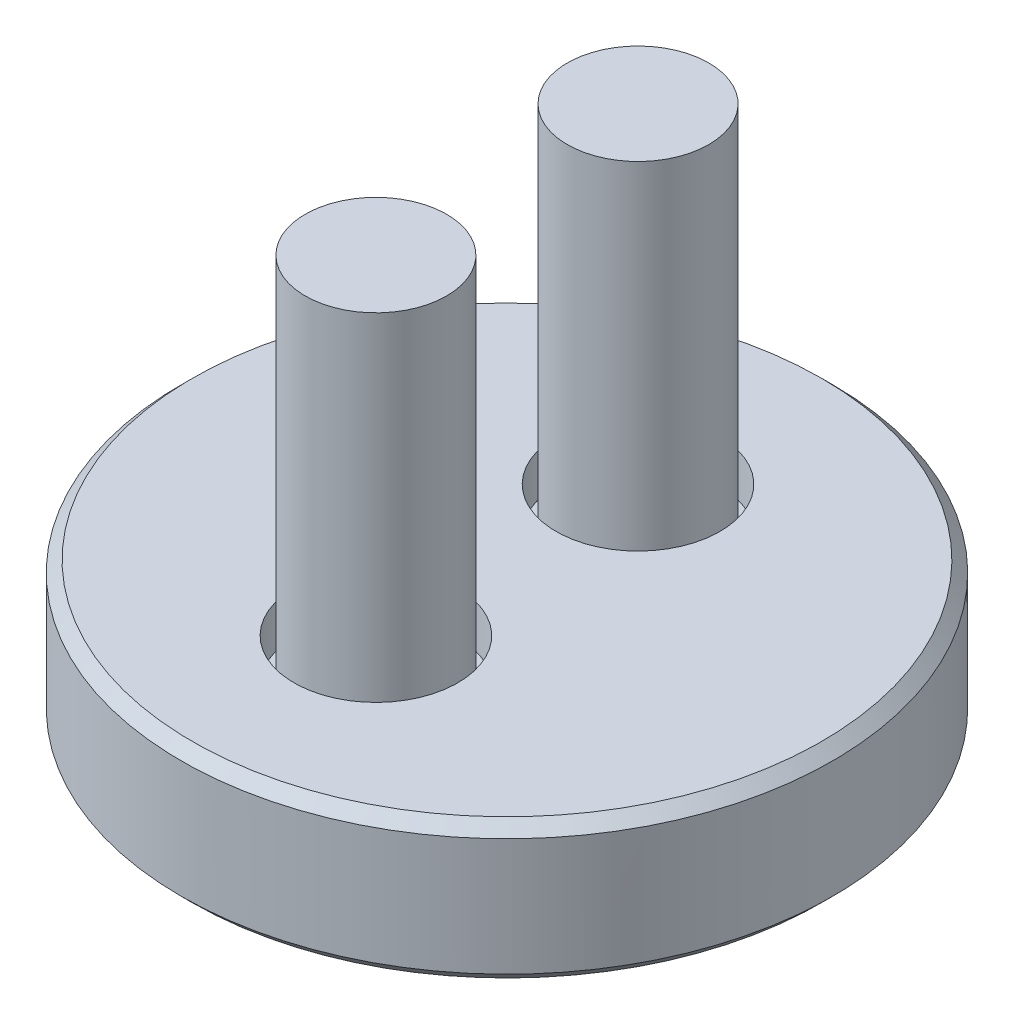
ISO-10303-21;
HEADER;
FILE_DESCRIPTION(('STEP AP214'),'2;1');
FILE_NAME('part.step','',(''),(''),'','','');
FILE_SCHEMA(('AUTOMOTIVE_DESIGN { 1 0 10303 214 1 1 1 1 }'));
ENDSEC;
DATA;
#1=APPLICATION_CONTEXT('core data for automotive mechanical design processes');
#2=APPLICATION_PROTOCOL_DEFINITION('international standard','automotive_design',2000,#1);
#3=PRODUCT_CONTEXT('',#1,'mechanical');
#4=PRODUCT('Part','Part','',(#3));
#5=PRODUCT_RELATED_PRODUCT_CATEGORY('part','',(#4));
#6=PRODUCT_DEFINITION_FORMATION('','',#4);
#7=PRODUCT_DEFINITION_CONTEXT('part definition',#1,'design');
#8=PRODUCT_DEFINITION('design','',#6,#7);
#9=PRODUCT_DEFINITION_SHAPE('','',#8);
#10=(LENGTH_UNIT() NAMED_UNIT(*) SI_UNIT(.MILLI.,.METRE.));
#11=(NAMED_UNIT(*) PLANE_ANGLE_UNIT() SI_UNIT($,.RADIAN.));
#12=(NAMED_UNIT(*) SI_UNIT($,.STERADIAN.) SOLID_ANGLE_UNIT());
#13=UNCERTAINTY_MEASURE_WITH_UNIT(LENGTH_MEASURE(1.E-05),#10,'distance_accuracy_value','');
#14=(GEOMETRIC_REPRESENTATION_CONTEXT(3) GLOBAL_UNCERTAINTY_ASSIGNED_CONTEXT((#13)) GLOBAL_UNIT_ASSIGNED_CONTEXT((#10,
#11,#12)) REPRESENTATION_CONTEXT('',''));
#15=CARTESIAN_POINT('',(0.,0.,0.));
#16=DIRECTION('',(0.,0.,1.));
#17=DIRECTION('',(1.,0.,0.));
#18=AXIS2_PLACEMENT_3D('',#15,#16,#17);
#19=CARTESIAN_POINT('',(0.,16.002,-4.4704));
#20=DIRECTION('',(0.,1.,0.));
#21=DIRECTION('',(1.,0.,0.));
#22=AXIS2_PLACEMENT_3D('',#19,#20,#21);
#23=PLANE('',#22);
#24=CARTESIAN_POINT('',(0.,16.002,-4.4704));
#25=DIRECTION('',(0.,-1.,0.));
#26=DIRECTION('',(1.,0.,0.));
#27=AXIS2_PLACEMENT_3D('',#24,#25,#26);
#28=CIRCLE('',#27,2.413);
#29=CARTESIAN_POINT('',(2.413,16.002,-4.4704));
#30=VERTEX_POINT('',#29);
#31=EDGE_CURVE('E12',#30,#30,#28,.T.);
#32=ORIENTED_EDGE('',*,*,#31,.F.);
#33=EDGE_LOOP('',(#32));
#34=FACE_BOUND('',#33,.T.);
#35=ADVANCED_FACE('F45',(#34),#23,.T.);
#36=CARTESIAN_POINT('',(0.,16.002,-4.4704));
#37=DIRECTION('',(0.,1.,0.));
#38=DIRECTION('',(1.,0.,0.));
#39=AXIS2_PLACEMENT_3D('',#36,#37,#38);
#40=CYLINDRICAL_SURFACE('',#39,2.413);
#41=CARTESIAN_POINT('',(0.,3.302,-4.4704));
#42=DIRECTION('',(0.,-1.,0.));
#43=DIRECTION('',(1.,0.,0.));
#44=AXIS2_PLACEMENT_3D('',#41,#42,#43);
#45=CIRCLE('',#44,2.413);
#46=CARTESIAN_POINT('',(2.413,3.302,-4.4704));
#47=VERTEX_POINT('',#46);
#48=EDGE_CURVE('E52',#47,#47,#45,.T.);
#49=ORIENTED_EDGE('',*,*,#48,.F.);
#50=EDGE_LOOP('',(#49));
#51=FACE_BOUND('',#50,.T.);
#52=ORIENTED_EDGE('',*,*,#31,.T.);
#53=EDGE_LOOP('',(#52));
#54=FACE_BOUND('',#53,.T.);
#55=ADVANCED_FACE('F144',(#51,#54),#40,.T.);
#56=CARTESIAN_POINT('',(0.,3.302,-6.8834));
#57=DIRECTION('',(0.,1.,0.));
#58=DIRECTION('',(1.,0.,0.));
#59=AXIS2_PLACEMENT_3D('',#56,#57,#58);
#60=PLANE('',#59);
#61=CARTESIAN_POINT('',(0.,3.302,-4.4704));
#62=DIRECTION('',(0.,-1.,0.));
#63=DIRECTION('',(1.,0.,0.));
#64=AXIS2_PLACEMENT_3D('',#61,#62,#63);
#65=CIRCLE('',#64,3.9624);
#66=CARTESIAN_POINT('',(3.9624,3.302,-4.4704));
#67=VERTEX_POINT('',#66);
#68=EDGE_CURVE('E137',#67,#67,#65,.T.);
#69=ORIENTED_EDGE('',*,*,#68,.F.);
#70=EDGE_LOOP('',(#69));
#71=FACE_BOUND('',#70,.T.);
#72=ORIENTED_EDGE('',*,*,#48,.T.);
#73=EDGE_LOOP('',(#72));
#74=FACE_BOUND('',#73,.T.);
#75=ADVANCED_FACE('F142',(#71,#74),#60,.T.);
#76=CARTESIAN_POINT('',(0.,16.002,-4.4704));
#77=DIRECTION('',(0.,1.,0.));
#78=DIRECTION('',(1.,0.,0.));
#79=AXIS2_PLACEMENT_3D('',#76,#77,#78);
#80=CYLINDRICAL_SURFACE('',#79,3.9624);
#81=CARTESIAN_POINT('',(0.,0.939800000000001,-4.4704));
#82=DIRECTION('',(0.,-1.,0.));
#83=DIRECTION('',(1.,0.,0.));
#84=AXIS2_PLACEMENT_3D('',#81,#82,#83);
#85=CIRCLE('',#84,3.9624);
#86=CARTESIAN_POINT('',(3.9624,0.939800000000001,-4.4704));
#87=VERTEX_POINT('',#86);
#88=EDGE_CURVE('E134',#87,#87,#85,.T.);
#89=ORIENTED_EDGE('',*,*,#88,.F.);
#90=EDGE_LOOP('',(#89));
#91=FACE_BOUND('',#90,.T.);
#92=ORIENTED_EDGE('',*,*,#68,.T.);
#93=EDGE_LOOP('',(#92));
#94=FACE_BOUND('',#93,.T.);
#95=ADVANCED_FACE('F162',(#91,#94),#80,.T.);
#96=CARTESIAN_POINT('',(0.,0.939800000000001,-8.4328));
#97=DIRECTION('',(0.,-1.,0.));
#98=DIRECTION('',(-1.,0.,0.));
#99=AXIS2_PLACEMENT_3D('',#96,#97,#98);
#100=PLANE('',#99);
#101=DIRECTION('',(0.866025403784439,0.,-0.5));
#102=VECTOR('',#101,1.);
#103=CARTESIAN_POINT('',(0.,0.939800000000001,-3.10658319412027));
#104=LINE('',#103,#102);
#105=CARTESIAN_POINT('',(0.,0.939800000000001,-3.10658319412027));
#106=VERTEX_POINT('',#105);
#107=CARTESIAN_POINT('',(1.1811,0.939800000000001,-3.78849159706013));
#108=VERTEX_POINT('',#107);
#109=EDGE_CURVE('E260',#106,#108,#104,.T.);
#110=ORIENTED_EDGE('',*,*,#109,.T.);
#111=DIRECTION('',(0.,0.,-1.));
#112=VECTOR('',#111,1.);
#113=CARTESIAN_POINT('',(1.1811,0.939800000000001,-3.78849159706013));
#114=LINE('',#113,#112);
#115=CARTESIAN_POINT('',(1.1811,0.939800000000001,-5.15230840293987));
#116=VERTEX_POINT('',#115);
#117=EDGE_CURVE('E254',#108,#116,#114,.T.);
#118=ORIENTED_EDGE('',*,*,#117,.T.);
#119=DIRECTION('',(-0.866025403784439,0.,-0.5));
#120=VECTOR('',#119,1.);
#121=CARTESIAN_POINT('',(1.1811,0.939800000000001,-5.15230840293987));
#122=LINE('',#121,#120);
#123=CARTESIAN_POINT('',(0.,0.939800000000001,-5.83421680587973));
#124=VERTEX_POINT('',#123);
#125=EDGE_CURVE('E259',#116,#124,#122,.T.);
#126=ORIENTED_EDGE('',*,*,#125,.T.);
#127=DIRECTION('',(-0.866025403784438,0.,0.5));
#128=VECTOR('',#127,1.);
#129=CARTESIAN_POINT('',(0.,0.939800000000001,-5.83421680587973));
#130=LINE('',#129,#128);
#131=CARTESIAN_POINT('',(-1.1811,0.939800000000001,-5.15230840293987));
#132=VERTEX_POINT('',#131);
#133=EDGE_CURVE('E268',#124,#132,#130,.T.);
#134=ORIENTED_EDGE('',*,*,#133,.T.);
#135=DIRECTION('',(0.,0.,1.));
#136=VECTOR('',#135,1.);
#137=CARTESIAN_POINT('',(-1.1811,0.939800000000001,-5.15230840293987));
#138=LINE('',#137,#136);
#139=CARTESIAN_POINT('',(-1.1811,0.939800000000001,-3.78849159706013));
#140=VERTEX_POINT('',#139);
#141=EDGE_CURVE('E123',#132,#140,#138,.T.);
#142=ORIENTED_EDGE('',*,*,#141,.T.);
#143=DIRECTION('',(0.866025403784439,0.,0.5));
#144=VECTOR('',#143,1.);
#145=CARTESIAN_POINT('',(-1.1811,0.939800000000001,-3.78849159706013));
#146=LINE('',#145,#144);
#147=EDGE_CURVE('E263',#140,#106,#146,.T.);
#148=ORIENTED_EDGE('',*,*,#147,.T.);
#149=EDGE_LOOP('',(#110,#118,#126,#134,#142,#148));
#150=FACE_BOUND('',#149,.T.);
#151=ORIENTED_EDGE('',*,*,#88,.T.);
#152=EDGE_LOOP('',(#151));
#153=FACE_BOUND('',#152,.T.);
#154=ADVANCED_FACE('F170',(#150,#153),#100,.T.);
#155=CARTESIAN_POINT('',(0.,2.9718,-3.10658319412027));
#156=DIRECTION('',(0.5,0.,0.866025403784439));
#157=DIRECTION('',(-0.866025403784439,0.,0.5));
#158=AXIS2_PLACEMENT_3D('',#155,#156,#157);
#159=PLANE('',#158);
#160=ORIENTED_EDGE('',*,*,#109,.F.);
#161=DIRECTION('',(0.,-1.,0.));
#162=VECTOR('',#161,1.);
#163=CARTESIAN_POINT('',(0.,2.9718,-3.10658319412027));
#164=LINE('',#163,#162);
#165=CARTESIAN_POINT('',(0.,2.9718,-3.10658319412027));
#166=VERTEX_POINT('',#165);
#167=EDGE_CURVE('E90',#166,#106,#164,.T.);
#168=ORIENTED_EDGE('',*,*,#167,.F.);
#169=DIRECTION('',(0.866025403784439,0.,-0.5));
#170=VECTOR('',#169,1.);
#171=CARTESIAN_POINT('',(0.,2.9718,-3.10658319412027));
#172=LINE('',#171,#170);
#173=CARTESIAN_POINT('',(1.1811,2.9718,-3.78849159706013));
#174=VERTEX_POINT('',#173);
#175=EDGE_CURVE('E271',#166,#174,#172,.T.);
#176=ORIENTED_EDGE('',*,*,#175,.T.);
#177=DIRECTION('',(0.,-1.,0.));
#178=VECTOR('',#177,1.);
#179=CARTESIAN_POINT('',(1.1811,2.9718,-3.78849159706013));
#180=LINE('',#179,#178);
#181=EDGE_CURVE('E59',#174,#108,#180,.T.);
#182=ORIENTED_EDGE('',*,*,#181,.T.);
#183=EDGE_LOOP('',(#160,#168,#176,#182));
#184=FACE_BOUND('',#183,.T.);
#185=ADVANCED_FACE('F178',(#184),#159,.F.);
#186=CARTESIAN_POINT('',(-1.1811,2.9718,-3.78849159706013));
#187=DIRECTION('',(-0.5,0.,0.866025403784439));
#188=DIRECTION('',(-0.866025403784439,0.,-0.5));
#189=AXIS2_PLACEMENT_3D('',#186,#187,#188);
#190=PLANE('',#189);
#191=ORIENTED_EDGE('',*,*,#147,.F.);
#192=DIRECTION('',(0.,-1.,0.));
#193=VECTOR('',#192,1.);
#194=CARTESIAN_POINT('',(-1.1811,2.9718,-3.78849159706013));
#195=LINE('',#194,#193);
#196=CARTESIAN_POINT('',(-1.1811,2.9718,-3.78849159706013));
#197=VERTEX_POINT('',#196);
#198=EDGE_CURVE('E125',#197,#140,#195,.T.);
#199=ORIENTED_EDGE('',*,*,#198,.F.);
#200=DIRECTION('',(0.866025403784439,0.,0.5));
#201=VECTOR('',#200,1.);
#202=CARTESIAN_POINT('',(-1.1811,2.9718,-3.78849159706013));
#203=LINE('',#202,#201);
#204=EDGE_CURVE('E68',#197,#166,#203,.T.);
#205=ORIENTED_EDGE('',*,*,#204,.T.);
#206=ORIENTED_EDGE('',*,*,#167,.T.);
#207=EDGE_LOOP('',(#191,#199,#205,#206));
#208=FACE_BOUND('',#207,.T.);
#209=ADVANCED_FACE('F186',(#208),#190,.F.);
#210=CARTESIAN_POINT('',(-1.1811,2.9718,-5.15230840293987));
#211=DIRECTION('',(-1.,0.,0.));
#212=DIRECTION('',(0.,0.,-1.));
#213=AXIS2_PLACEMENT_3D('',#210,#211,#212);
#214=PLANE('',#213);
#215=ORIENTED_EDGE('',*,*,#141,.F.);
#216=DIRECTION('',(0.,-1.,0.));
#217=VECTOR('',#216,1.);
#218=CARTESIAN_POINT('',(-1.1811,2.9718,-5.15230840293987));
#219=LINE('',#218,#217);
#220=CARTESIAN_POINT('',(-1.1811,2.9718,-5.15230840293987));
#221=VERTEX_POINT('',#220);
#222=EDGE_CURVE('E112',#221,#132,#219,.T.);
#223=ORIENTED_EDGE('',*,*,#222,.F.);
#224=DIRECTION('',(0.,0.,1.));
#225=VECTOR('',#224,1.);
#226=CARTESIAN_POINT('',(-1.1811,2.9718,-5.15230840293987));
#227=LINE('',#226,#225);
#228=EDGE_CURVE('E115',#221,#197,#227,.T.);
#229=ORIENTED_EDGE('',*,*,#228,.T.);
#230=ORIENTED_EDGE('',*,*,#198,.T.);
#231=EDGE_LOOP('',(#215,#223,#229,#230));
#232=FACE_BOUND('',#231,.T.);
#233=ADVANCED_FACE('F121',(#232),#214,.F.);
#234=CARTESIAN_POINT('',(0.,2.9718,-5.83421680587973));
#235=DIRECTION('',(-0.5,0.,-0.866025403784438));
#236=DIRECTION('',(0.866025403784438,0.,-0.5));
#237=AXIS2_PLACEMENT_3D('',#234,#235,#236);
#238=PLANE('',#237);
#239=ORIENTED_EDGE('',*,*,#133,.F.);
#240=DIRECTION('',(0.,-1.,0.));
#241=VECTOR('',#240,1.);
#242=CARTESIAN_POINT('',(0.,2.9718,-5.83421680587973));
#243=LINE('',#242,#241);
#244=CARTESIAN_POINT('',(0.,2.9718,-5.83421680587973));
#245=VERTEX_POINT('',#244);
#246=EDGE_CURVE('E114',#245,#124,#243,.T.);
#247=ORIENTED_EDGE('',*,*,#246,.F.);
#248=DIRECTION('',(-0.866025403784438,0.,0.5));
#249=VECTOR('',#248,1.);
#250=CARTESIAN_POINT('',(0.,2.9718,-5.83421680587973));
#251=LINE('',#250,#249);
#252=EDGE_CURVE('E107',#245,#221,#251,.T.);
#253=ORIENTED_EDGE('',*,*,#252,.T.);
#254=ORIENTED_EDGE('',*,*,#222,.T.);
#255=EDGE_LOOP('',(#239,#247,#253,#254));
#256=FACE_BOUND('',#255,.T.);
#257=ADVANCED_FACE('F110',(#256),#238,.F.);
#258=CARTESIAN_POINT('',(1.1811,2.9718,-5.15230840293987));
#259=DIRECTION('',(0.5,0.,-0.866025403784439));
#260=DIRECTION('',(0.866025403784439,0.,0.5));
#261=AXIS2_PLACEMENT_3D('',#258,#259,#260);
#262=PLANE('',#261);
#263=ORIENTED_EDGE('',*,*,#125,.F.);
#264=DIRECTION('',(0.,-1.,0.));
#265=VECTOR('',#264,1.);
#266=CARTESIAN_POINT('',(1.1811,2.9718,-5.15230840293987));
#267=LINE('',#266,#265);
#268=CARTESIAN_POINT('',(1.1811,2.9718,-5.15230840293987));
#269=VERTEX_POINT('',#268);
#270=EDGE_CURVE('E128',#269,#116,#267,.T.);
#271=ORIENTED_EDGE('',*,*,#270,.F.);
#272=DIRECTION('',(-0.866025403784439,0.,-0.5));
#273=VECTOR('',#272,1.);
#274=CARTESIAN_POINT('',(1.1811,2.9718,-5.15230840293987));
#275=LINE('',#274,#273);
#276=EDGE_CURVE('E116',#269,#245,#275,.T.);
#277=ORIENTED_EDGE('',*,*,#276,.T.);
#278=ORIENTED_EDGE('',*,*,#246,.T.);
#279=EDGE_LOOP('',(#263,#271,#277,#278));
#280=FACE_BOUND('',#279,.T.);
#281=ADVANCED_FACE('F205',(#280),#262,.F.);
#282=CARTESIAN_POINT('',(1.1811,2.9718,-3.78849159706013));
#283=DIRECTION('',(1.,0.,0.));
#284=DIRECTION('',(0.,-1.,0.));
#285=AXIS2_PLACEMENT_3D('',#282,#283,#284);
#286=PLANE('',#285);
#287=ORIENTED_EDGE('',*,*,#117,.F.);
#288=ORIENTED_EDGE('',*,*,#181,.F.);
#289=DIRECTION('',(0.,0.,-1.));
#290=VECTOR('',#289,1.);
#291=CARTESIAN_POINT('',(1.1811,2.9718,-3.78849159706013));
#292=LINE('',#291,#290);
#293=EDGE_CURVE('E98',#174,#269,#292,.T.);
#294=ORIENTED_EDGE('',*,*,#293,.T.);
#295=ORIENTED_EDGE('',*,*,#270,.T.);
#296=EDGE_LOOP('',(#287,#288,#294,#295));
#297=FACE_BOUND('',#296,.T.);
#298=ADVANCED_FACE('F212',(#297),#286,.F.);
#299=CARTESIAN_POINT('',(2.3622,2.9718,-4.4704));
#300=DIRECTION('',(0.,-1.,0.));
#301=DIRECTION('',(-1.,0.,0.));
#302=AXIS2_PLACEMENT_3D('',#299,#300,#301);
#303=PLANE('',#302);
#304=ORIENTED_EDGE('',*,*,#175,.F.);
#305=ORIENTED_EDGE('',*,*,#204,.F.);
#306=ORIENTED_EDGE('',*,*,#228,.F.);
#307=ORIENTED_EDGE('',*,*,#252,.F.);
#308=ORIENTED_EDGE('',*,*,#276,.F.);
#309=ORIENTED_EDGE('',*,*,#293,.F.);
#310=EDGE_LOOP('',(#304,#305,#306,#307,#308,#309));
#311=FACE_BOUND('',#310,.T.);
#312=ADVANCED_FACE('F118',(#311),#303,.T.);
#313=CLOSED_SHELL('',(#35,#55,#75,#95,#154,#185,#209,#233,#257,#281,#298,#312));
#314=MANIFOLD_SOLID_BREP('B2',#313);
#315=CARTESIAN_POINT('',(0.,16.002,4.4704));
#316=DIRECTION('',(0.,1.,0.));
#317=DIRECTION('',(1.,0.,0.));
#318=AXIS2_PLACEMENT_3D('',#315,#316,#317);
#319=PLANE('',#318);
#320=CARTESIAN_POINT('',(0.,16.002,4.4704));
#321=DIRECTION('',(0.,1.,0.));
#322=DIRECTION('',(1.,0.,0.));
#323=AXIS2_PLACEMENT_3D('',#320,#321,#322);
#324=CIRCLE('',#323,2.413);
#325=CARTESIAN_POINT('',(2.413,16.002,4.4704));
#326=VERTEX_POINT('',#325);
#327=EDGE_CURVE('E43',#326,#326,#324,.T.);
#328=ORIENTED_EDGE('',*,*,#327,.T.);
#329=EDGE_LOOP('',(#328));
#330=FACE_BOUND('',#329,.T.);
#331=ADVANCED_FACE('F290',(#330),#319,.T.);
#332=CARTESIAN_POINT('',(0.,16.002,4.4704));
#333=DIRECTION('',(0.,1.,0.));
#334=DIRECTION('',(1.,0.,0.));
#335=AXIS2_PLACEMENT_3D('',#332,#333,#334);
#336=CYLINDRICAL_SURFACE('',#335,2.413);
#337=CARTESIAN_POINT('',(0.,3.302,4.4704));
#338=DIRECTION('',(0.,1.,0.));
#339=DIRECTION('',(1.,0.,0.));
#340=AXIS2_PLACEMENT_3D('',#337,#338,#339);
#341=CIRCLE('',#340,2.413);
#342=CARTESIAN_POINT('',(2.413,3.302,4.4704));
#343=VERTEX_POINT('',#342);
#344=EDGE_CURVE('E297',#343,#343,#341,.T.);
#345=ORIENTED_EDGE('',*,*,#344,.T.);
#346=EDGE_LOOP('',(#345));
#347=FACE_BOUND('',#346,.T.);
#348=ORIENTED_EDGE('',*,*,#327,.F.);
#349=EDGE_LOOP('',(#348));
#350=FACE_BOUND('',#349,.T.);
#351=ADVANCED_FACE('F404',(#347,#350),#336,.T.);
#352=CARTESIAN_POINT('',(0.,3.302,6.8834));
#353=DIRECTION('',(0.,1.,0.));
#354=DIRECTION('',(1.,0.,0.));
#355=AXIS2_PLACEMENT_3D('',#352,#353,#354);
#356=PLANE('',#355);
#357=CARTESIAN_POINT('',(0.,3.302,4.4704));
#358=DIRECTION('',(0.,1.,0.));
#359=DIRECTION('',(1.,0.,0.));
#360=AXIS2_PLACEMENT_3D('',#357,#358,#359);
#361=CIRCLE('',#360,3.9624);
#362=CARTESIAN_POINT('',(3.9624,3.302,4.4704));
#363=VERTEX_POINT('',#362);
#364=EDGE_CURVE('E399',#363,#363,#361,.T.);
#365=ORIENTED_EDGE('',*,*,#364,.T.);
#366=EDGE_LOOP('',(#365));
#367=FACE_BOUND('',#366,.T.);
#368=ORIENTED_EDGE('',*,*,#344,.F.);
#369=EDGE_LOOP('',(#368));
#370=FACE_BOUND('',#369,.T.);
#371=ADVANCED_FACE('F407',(#367,#370),#356,.T.);
#372=CARTESIAN_POINT('',(0.,16.002,4.4704));
#373=DIRECTION('',(0.,1.,0.));
#374=DIRECTION('',(1.,0.,0.));
#375=AXIS2_PLACEMENT_3D('',#372,#373,#374);
#376=CYLINDRICAL_SURFACE('',#375,3.9624);
#377=CARTESIAN_POINT('',(0.,0.939800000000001,4.4704));
#378=DIRECTION('',(0.,1.,0.));
#379=DIRECTION('',(1.,0.,0.));
#380=AXIS2_PLACEMENT_3D('',#377,#378,#379);
#381=CIRCLE('',#380,3.9624);
#382=CARTESIAN_POINT('',(3.9624,0.939800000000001,4.4704));
#383=VERTEX_POINT('',#382);
#384=EDGE_CURVE('E391',#383,#383,#381,.T.);
#385=ORIENTED_EDGE('',*,*,#384,.T.);
#386=EDGE_LOOP('',(#385));
#387=FACE_BOUND('',#386,.T.);
#388=ORIENTED_EDGE('',*,*,#364,.F.);
#389=EDGE_LOOP('',(#388));
#390=FACE_BOUND('',#389,.T.);
#391=ADVANCED_FACE('F409',(#387,#390),#376,.T.);
#392=CARTESIAN_POINT('',(0.,0.939800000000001,8.4328));
#393=DIRECTION('',(0.,-1.,0.));
#394=DIRECTION('',(-1.,0.,0.));
#395=AXIS2_PLACEMENT_3D('',#392,#393,#394);
#396=PLANE('',#395);
#397=DIRECTION('',(0.866025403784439,0.,0.5));
#398=VECTOR('',#397,1.);
#399=CARTESIAN_POINT('',(0.,0.939800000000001,3.10658319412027));
#400=LINE('',#399,#398);
#401=CARTESIAN_POINT('',(0.,0.939800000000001,3.10658319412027));
#402=VERTEX_POINT('',#401);
#403=CARTESIAN_POINT('',(1.1811,0.939800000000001,3.78849159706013));
#404=VERTEX_POINT('',#403);
#405=EDGE_CURVE('E304',#402,#404,#400,.T.);
#406=ORIENTED_EDGE('',*,*,#405,.F.);
#407=DIRECTION('',(0.866025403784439,0.,-0.5));
#408=VECTOR('',#407,1.);
#409=CARTESIAN_POINT('',(-1.1811,0.939800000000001,3.78849159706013));
#410=LINE('',#409,#408);
#411=CARTESIAN_POINT('',(-1.1811,0.939800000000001,3.78849159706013));
#412=VERTEX_POINT('',#411);
#413=EDGE_CURVE('E387',#412,#402,#410,.T.);
#414=ORIENTED_EDGE('',*,*,#413,.F.);
#415=DIRECTION('',(0.,0.,-1.));
#416=VECTOR('',#415,1.);
#417=CARTESIAN_POINT('',(-1.1811,0.939800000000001,5.15230840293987));
#418=LINE('',#417,#416);
#419=CARTESIAN_POINT('',(-1.1811,0.939800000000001,5.15230840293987));
#420=VERTEX_POINT('',#419);
#421=EDGE_CURVE('E385',#420,#412,#418,.T.);
#422=ORIENTED_EDGE('',*,*,#421,.F.);
#423=DIRECTION('',(-0.866025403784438,0.,-0.5));
#424=VECTOR('',#423,1.);
#425=CARTESIAN_POINT('',(0.,0.939800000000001,5.83421680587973));
#426=LINE('',#425,#424);
#427=CARTESIAN_POINT('',(0.,0.939800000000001,5.83421680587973));
#428=VERTEX_POINT('',#427);
#429=EDGE_CURVE('E352',#428,#420,#426,.T.);
#430=ORIENTED_EDGE('',*,*,#429,.F.);
#431=DIRECTION('',(-0.866025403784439,0.,0.5));
#432=VECTOR('',#431,1.);
#433=CARTESIAN_POINT('',(1.1811,0.939800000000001,5.15230840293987));
#434=LINE('',#433,#432);
#435=CARTESIAN_POINT('',(1.1811,0.939800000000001,5.15230840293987));
#436=VERTEX_POINT('',#435);
#437=EDGE_CURVE('E381',#436,#428,#434,.T.);
#438=ORIENTED_EDGE('',*,*,#437,.F.);
#439=DIRECTION('',(0.,0.,1.));
#440=VECTOR('',#439,1.);
#441=CARTESIAN_POINT('',(1.1811,0.939800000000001,3.78849159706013));
#442=LINE('',#441,#440);
#443=EDGE_CURVE('E378',#404,#436,#442,.T.);
#444=ORIENTED_EDGE('',*,*,#443,.F.);
#445=EDGE_LOOP('',(#406,#414,#422,#430,#438,#444));
#446=FACE_BOUND('',#445,.T.);
#447=ORIENTED_EDGE('',*,*,#384,.F.);
#448=EDGE_LOOP('',(#447));
#449=FACE_BOUND('',#448,.T.);
#450=ADVANCED_FACE('F416',(#446,#449),#396,.T.);
#451=CARTESIAN_POINT('',(0.,2.9718,3.10658319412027));
#452=DIRECTION('',(0.5,0.,-0.866025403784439));
#453=DIRECTION('',(-0.866025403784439,0.,-0.5));
#454=AXIS2_PLACEMENT_3D('',#451,#452,#453);
#455=PLANE('',#454);
#456=ORIENTED_EDGE('',*,*,#405,.T.);
#457=DIRECTION('',(0.,-1.,0.));
#458=VECTOR('',#457,1.);
#459=CARTESIAN_POINT('',(1.1811,2.9718,3.78849159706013));
#460=LINE('',#459,#458);
#461=CARTESIAN_POINT('',(1.1811,2.9718,3.78849159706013));
#462=VERTEX_POINT('',#461);
#463=EDGE_CURVE('E334',#462,#404,#460,.T.);
#464=ORIENTED_EDGE('',*,*,#463,.F.);
#465=DIRECTION('',(0.866025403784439,0.,0.5));
#466=VECTOR('',#465,1.);
#467=CARTESIAN_POINT('',(0.,2.9718,3.10658319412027));
#468=LINE('',#467,#466);
#469=CARTESIAN_POINT('',(0.,2.9718,3.10658319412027));
#470=VERTEX_POINT('',#469);
#471=EDGE_CURVE('E389',#470,#462,#468,.T.);
#472=ORIENTED_EDGE('',*,*,#471,.F.);
#473=DIRECTION('',(0.,-1.,0.));
#474=VECTOR('',#473,1.);
#475=CARTESIAN_POINT('',(0.,2.9718,3.10658319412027));
#476=LINE('',#475,#474);
#477=EDGE_CURVE('E312',#470,#402,#476,.T.);
#478=ORIENTED_EDGE('',*,*,#477,.T.);
#479=EDGE_LOOP('',(#456,#464,#472,#478));
#480=FACE_BOUND('',#479,.T.);
#481=ADVANCED_FACE('F441',(#480),#455,.F.);
#482=CARTESIAN_POINT('',(-1.1811,2.9718,3.78849159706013));
#483=DIRECTION('',(-0.5,0.,-0.866025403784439));
#484=DIRECTION('',(-0.866025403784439,0.,0.5));
#485=AXIS2_PLACEMENT_3D('',#482,#483,#484);
#486=PLANE('',#485);
#487=ORIENTED_EDGE('',*,*,#413,.T.);
#488=ORIENTED_EDGE('',*,*,#477,.F.);
#489=DIRECTION('',(0.866025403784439,0.,-0.5));
#490=VECTOR('',#489,1.);
#491=CARTESIAN_POINT('',(-1.1811,2.9718,3.78849159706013));
#492=LINE('',#491,#490);
#493=CARTESIAN_POINT('',(-1.1811,2.9718,3.78849159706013));
#494=VERTEX_POINT('',#493);
#495=EDGE_CURVE('E364',#494,#470,#492,.T.);
#496=ORIENTED_EDGE('',*,*,#495,.F.);
#497=DIRECTION('',(0.,-1.,0.));
#498=VECTOR('',#497,1.);
#499=CARTESIAN_POINT('',(-1.1811,2.9718,3.78849159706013));
#500=LINE('',#499,#498);
#501=EDGE_CURVE('E356',#494,#412,#500,.T.);
#502=ORIENTED_EDGE('',*,*,#501,.T.);
#503=EDGE_LOOP('',(#487,#488,#496,#502));
#504=FACE_BOUND('',#503,.T.);
#505=ADVANCED_FACE('F449',(#504),#486,.F.);
#506=CARTESIAN_POINT('',(-1.1811,2.9718,5.15230840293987));
#507=DIRECTION('',(-1.,0.,0.));
#508=DIRECTION('',(0.,0.,1.));
#509=AXIS2_PLACEMENT_3D('',#506,#507,#508);
#510=PLANE('',#509);
#511=ORIENTED_EDGE('',*,*,#421,.T.);
#512=ORIENTED_EDGE('',*,*,#501,.F.);
#513=DIRECTION('',(0.,0.,-1.));
#514=VECTOR('',#513,1.);
#515=CARTESIAN_POINT('',(-1.1811,2.9718,5.15230840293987));
#516=LINE('',#515,#514);
#517=CARTESIAN_POINT('',(-1.1811,2.9718,5.15230840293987));
#518=VERTEX_POINT('',#517);
#519=EDGE_CURVE('E360',#518,#494,#516,.T.);
#520=ORIENTED_EDGE('',*,*,#519,.F.);
#521=DIRECTION('',(0.,-1.,0.));
#522=VECTOR('',#521,1.);
#523=CARTESIAN_POINT('',(-1.1811,2.9718,5.15230840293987));
#524=LINE('',#523,#522);
#525=EDGE_CURVE('E345',#518,#420,#524,.T.);
#526=ORIENTED_EDGE('',*,*,#525,.T.);
#527=EDGE_LOOP('',(#511,#512,#520,#526));
#528=FACE_BOUND('',#527,.T.);
#529=ADVANCED_FACE('F361',(#528),#510,.F.);
#530=CARTESIAN_POINT('',(0.,2.9718,5.83421680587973));
#531=DIRECTION('',(-0.5,0.,0.866025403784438));
#532=DIRECTION('',(0.866025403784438,0.,0.5));
#533=AXIS2_PLACEMENT_3D('',#530,#531,#532);
#534=PLANE('',#533);
#535=ORIENTED_EDGE('',*,*,#429,.T.);
#536=ORIENTED_EDGE('',*,*,#525,.F.);
#537=DIRECTION('',(-0.866025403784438,0.,-0.5));
#538=VECTOR('',#537,1.);
#539=CARTESIAN_POINT('',(0.,2.9718,5.83421680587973));
#540=LINE('',#539,#538);
#541=CARTESIAN_POINT('',(0.,2.9718,5.83421680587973));
#542=VERTEX_POINT('',#541);
#543=EDGE_CURVE('E349',#542,#518,#540,.T.);
#544=ORIENTED_EDGE('',*,*,#543,.F.);
#545=DIRECTION('',(0.,-1.,0.));
#546=VECTOR('',#545,1.);
#547=CARTESIAN_POINT('',(0.,2.9718,5.83421680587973));
#548=LINE('',#547,#546);
#549=EDGE_CURVE('E357',#542,#428,#548,.T.);
#550=ORIENTED_EDGE('',*,*,#549,.T.);
#551=EDGE_LOOP('',(#535,#536,#544,#550));
#552=FACE_BOUND('',#551,.T.);
#553=ADVANCED_FACE('F347',(#552),#534,.F.);
#554=CARTESIAN_POINT('',(1.1811,2.9718,5.15230840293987));
#555=DIRECTION('',(0.5,0.,0.866025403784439));
#556=DIRECTION('',(0.866025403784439,0.,-0.5));
#557=AXIS2_PLACEMENT_3D('',#554,#555,#556);
#558=PLANE('',#557);
#559=ORIENTED_EDGE('',*,*,#437,.T.);
#560=ORIENTED_EDGE('',*,*,#549,.F.);
#561=DIRECTION('',(-0.866025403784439,0.,0.5));
#562=VECTOR('',#561,1.);
#563=CARTESIAN_POINT('',(1.1811,2.9718,5.15230840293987));
#564=LINE('',#563,#562);
#565=CARTESIAN_POINT('',(1.1811,2.9718,5.15230840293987));
#566=VERTEX_POINT('',#565);
#567=EDGE_CURVE('E370',#566,#542,#564,.T.);
#568=ORIENTED_EDGE('',*,*,#567,.F.);
#569=DIRECTION('',(0.,-1.,0.));
#570=VECTOR('',#569,1.);
#571=CARTESIAN_POINT('',(1.1811,2.9718,5.15230840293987));
#572=LINE('',#571,#570);
#573=EDGE_CURVE('E394',#566,#436,#572,.T.);
#574=ORIENTED_EDGE('',*,*,#573,.T.);
#575=EDGE_LOOP('',(#559,#560,#568,#574));
#576=FACE_BOUND('',#575,.T.);
#577=ADVANCED_FACE('F468',(#576),#558,.F.);
#578=CARTESIAN_POINT('',(1.1811,2.9718,3.78849159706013));
#579=DIRECTION('',(1.,0.,0.));
#580=DIRECTION('',(0.,-1.,0.));
#581=AXIS2_PLACEMENT_3D('',#578,#579,#580);
#582=PLANE('',#581);
#583=ORIENTED_EDGE('',*,*,#443,.T.);
#584=ORIENTED_EDGE('',*,*,#573,.F.);
#585=DIRECTION('',(0.,0.,1.));
#586=VECTOR('',#585,1.);
#587=CARTESIAN_POINT('',(1.1811,2.9718,3.78849159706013));
#588=LINE('',#587,#586);
#589=EDGE_CURVE('E372',#462,#566,#588,.T.);
#590=ORIENTED_EDGE('',*,*,#589,.F.);
#591=ORIENTED_EDGE('',*,*,#463,.T.);
#592=EDGE_LOOP('',(#583,#584,#590,#591));
#593=FACE_BOUND('',#592,.T.);
#594=ADVANCED_FACE('F475',(#593),#582,.F.);
#595=CARTESIAN_POINT('',(2.3622,2.9718,4.4704));
#596=DIRECTION('',(0.,-1.,0.));
#597=DIRECTION('',(-1.,0.,0.));
#598=AXIS2_PLACEMENT_3D('',#595,#596,#597);
#599=PLANE('',#598);
#600=ORIENTED_EDGE('',*,*,#471,.T.);
#601=ORIENTED_EDGE('',*,*,#589,.T.);
#602=ORIENTED_EDGE('',*,*,#567,.T.);
#603=ORIENTED_EDGE('',*,*,#543,.T.);
#604=ORIENTED_EDGE('',*,*,#519,.T.);
#605=ORIENTED_EDGE('',*,*,#495,.T.);
#606=EDGE_LOOP('',(#600,#601,#602,#603,#604,#605));
#607=FACE_BOUND('',#606,.T.);
#608=ADVANCED_FACE('F367',(#607),#599,.T.);
#609=CLOSED_SHELL('',(#331,#351,#371,#391,#450,#481,#505,#529,#553,#577,#594,#608));
#610=MANIFOLD_SOLID_BREP('B6',#609);
#611=CARTESIAN_POINT('',(0.,4.7625,0.));
#612=DIRECTION('',(0.,-1.,0.));
#613=DIRECTION('',(0.,0.,-1.));
#614=AXIS2_PLACEMENT_3D('',#611,#612,#613);
#615=CYLINDRICAL_SURFACE('',#614,11.1125);
#616=CARTESIAN_POINT('',(0.,0.381000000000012,0.));
#617=DIRECTION('',(0.,1.,0.));
#618=DIRECTION('',(0.,0.,1.));
#619=AXIS2_PLACEMENT_3D('',#616,#617,#618);
#620=CIRCLE('',#619,11.1125);
#621=CARTESIAN_POINT('',(0.,0.381000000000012,-11.1125));
#622=VERTEX_POINT('',#621);
#623=EDGE_CURVE('E593',#622,#622,#620,.T.);
#624=CARTESIAN_POINT('',(0.,4.38150000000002,0.));
#625=DIRECTION('',(0.,1.,0.));
#626=DIRECTION('',(0.,0.,1.));
#627=AXIS2_PLACEMENT_3D('',#624,#625,#626);
#628=CIRCLE('',#627,11.1125);
#629=CARTESIAN_POINT('',(0.,4.38150000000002,-11.1125));
#630=VERTEX_POINT('',#629);
#631=EDGE_CURVE('E590',#630,#630,#628,.F.);
#632=CARTESIAN_POINT('',(0.,0.381000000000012,-11.1125));
#633=CARTESIAN_POINT('',(0.,0.422671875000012,-11.1125));
#634=CARTESIAN_POINT('',(0.,0.464343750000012,-11.1125));
#635=CARTESIAN_POINT('',(0.,0.547687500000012,-11.1125));
#636=CARTESIAN_POINT('',(0.,0.589359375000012,-11.1125));
#637=CARTESIAN_POINT('',(0.,0.672703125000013,-11.1125));
#638=CARTESIAN_POINT('',(0.,0.714375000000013,-11.1125));
#639=CARTESIAN_POINT('',(0.,0.797718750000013,-11.1125));
#640=CARTESIAN_POINT('',(0.,0.839390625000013,-11.1125));
#641=CARTESIAN_POINT('',(0.,0.922734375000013,-11.1125));
#642=CARTESIAN_POINT('',(0.,0.964406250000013,-11.1125));
#643=CARTESIAN_POINT('',(0.,1.04775000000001,-11.1125));
#644=CARTESIAN_POINT('',(0.,1.08942187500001,-11.1125));
#645=CARTESIAN_POINT('',(0.,1.17276562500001,-11.1125));
#646=CARTESIAN_POINT('',(0.,1.21443750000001,-11.1125));
#647=CARTESIAN_POINT('',(0.,1.29778125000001,-11.1125));
#648=CARTESIAN_POINT('',(0.,1.33945312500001,-11.1125));
#649=CARTESIAN_POINT('',(0.,1.42279687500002,-11.1125));
#650=CARTESIAN_POINT('',(0.,1.46446875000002,-11.1125));
#651=CARTESIAN_POINT('',(0.,1.54781250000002,-11.1125));
#652=CARTESIAN_POINT('',(0.,1.58948437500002,-11.1125));
#653=CARTESIAN_POINT('',(0.,1.67282812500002,-11.1125));
#654=CARTESIAN_POINT('',(0.,1.71450000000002,-11.1125));
#655=CARTESIAN_POINT('',(0.,1.79784375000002,-11.1125));
#656=CARTESIAN_POINT('',(0.,1.83951562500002,-11.1125));
#657=CARTESIAN_POINT('',(0.,1.92285937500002,-11.1125));
#658=CARTESIAN_POINT('',(0.,1.96453125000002,-11.1125));
#659=CARTESIAN_POINT('',(0.,2.04787500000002,-11.1125));
#660=CARTESIAN_POINT('',(0.,2.08954687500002,-11.1125));
#661=CARTESIAN_POINT('',(0.,2.17289062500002,-11.1125));
#662=CARTESIAN_POINT('',(0.,2.21456250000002,-11.1125));
#663=CARTESIAN_POINT('',(0.,2.29790625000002,-11.1125));
#664=CARTESIAN_POINT('',(0.,2.33957812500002,-11.1125));
#665=CARTESIAN_POINT('',(0.,2.42292187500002,-11.1125));
#666=CARTESIAN_POINT('',(0.,2.46459375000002,-11.1125));
#667=CARTESIAN_POINT('',(0.,2.54793750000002,-11.1125));
#668=CARTESIAN_POINT('',(0.,2.58960937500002,-11.1125));
#669=CARTESIAN_POINT('',(0.,2.67295312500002,-11.1125));
#670=CARTESIAN_POINT('',(0.,2.71462500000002,-11.1125));
#671=CARTESIAN_POINT('',(0.,2.79796875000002,-11.1125));
#672=CARTESIAN_POINT('',(0.,2.83964062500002,-11.1125));
#673=CARTESIAN_POINT('',(0.,2.92298437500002,-11.1125));
#674=CARTESIAN_POINT('',(0.,2.96465625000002,-11.1125));
#675=CARTESIAN_POINT('',(0.,3.04800000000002,-11.1125));
#676=CARTESIAN_POINT('',(0.,3.08967187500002,-11.1125));
#677=CARTESIAN_POINT('',(0.,3.17301562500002,-11.1125));
#678=CARTESIAN_POINT('',(0.,3.21468750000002,-11.1125));
#679=CARTESIAN_POINT('',(0.,3.29803125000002,-11.1125));
#680=CARTESIAN_POINT('',(0.,3.33970312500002,-11.1125));
#681=CARTESIAN_POINT('',(0.,3.42304687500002,-11.1125));
#682=CARTESIAN_POINT('',(0.,3.46471875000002,-11.1125));
#683=CARTESIAN_POINT('',(0.,3.54806250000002,-11.1125));
#684=CARTESIAN_POINT('',(0.,3.58973437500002,-11.1125));
#685=CARTESIAN_POINT('',(0.,3.67307812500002,-11.1125));
#686=CARTESIAN_POINT('',(0.,3.71475000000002,-11.1125));
#687=CARTESIAN_POINT('',(0.,3.79809375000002,-11.1125));
#688=CARTESIAN_POINT('',(0.,3.83976562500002,-11.1125));
#689=CARTESIAN_POINT('',(0.,3.92310937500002,-11.1125));
#690=CARTESIAN_POINT('',(0.,3.96478125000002,-11.1125));
#691=CARTESIAN_POINT('',(0.,4.04812500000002,-11.1125));
#692=CARTESIAN_POINT('',(0.,4.08979687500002,-11.1125));
#693=CARTESIAN_POINT('',(0.,4.17314062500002,-11.1125));
#694=CARTESIAN_POINT('',(0.,4.21481250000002,-11.1125));
#695=CARTESIAN_POINT('',(0.,4.29815625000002,-11.1125));
#696=CARTESIAN_POINT('',(0.,4.33982812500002,-11.1125));
#697=CARTESIAN_POINT('',(0.,4.38150000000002,-11.1125));
#698=B_SPLINE_CURVE_WITH_KNOTS('',3,(#632,#633,#634,#635,#636,#637,#638,#639,#640,#641,#642,
#643,#644,#645,#646,#647,#648,#649,#650,#651,#652,#653,#654,#655,#656,#657,#658,#659,#660,#661,
#662,#663,#664,#665,#666,#667,#668,#669,#670,#671,#672,#673,#674,#675,#676,#677,#678,#679,#680,
#681,#682,#683,#684,#685,#686,#687,#688,#689,#690,#691,#692,#693,#694,#695,#696,#697),
.UNSPECIFIED.,.F.,.F.,(4,2,2,2,2,2,2,2,2,2,2,2,2,2,2,2,2,2,2,2,2,2,2,2,2,2,2,2,2,2,2,2,4),(0.,
0.125015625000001,0.250031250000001,0.375046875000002,0.500062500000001,0.625078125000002,
0.750093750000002,0.875109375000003,1.000125,1.125140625,1.25015625,1.375171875,1.5001875,
1.62520312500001,1.75021875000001,1.87523437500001,2.00025000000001,2.12526562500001,
2.25028125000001,2.37529687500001,2.50031250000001,2.62532812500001,2.75034375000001,
2.87535937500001,3.00037500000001,3.12539062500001,3.25040625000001,3.37542187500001,
3.50043750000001,3.62545312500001,3.75046875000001,3.87548437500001,4.00050000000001),.UNSPECIFIED.);
#699=EDGE_CURVE('BSEAM501',#622,#630,#698,.T.);
#700=ORIENTED_EDGE('',*,*,#623,.T.);
#701=ORIENTED_EDGE('',*,*,#631,.T.);
#702=ORIENTED_EDGE('',*,*,#699,.T.);
#703=ORIENTED_EDGE('',*,*,#699,.F.);
#704=EDGE_LOOP('',(#700,#702,#701,#703));
#705=FACE_BOUND('',#704,.T.);
#706=ADVANCED_FACE('F501',(#705),#615,.T.);
#707=CARTESIAN_POINT('',(0.,4.7625,0.));
#708=DIRECTION('',(0.,1.,0.));
#709=DIRECTION('',(0.,0.,1.));
#710=AXIS2_PLACEMENT_3D('',#707,#708,#709);
#711=PLANE('',#710);
#712=CARTESIAN_POINT('',(0.,4.7625,-4.4704));
#713=DIRECTION('',(0.,-1.,0.));
#714=DIRECTION('',(0.,0.,-1.));
#715=AXIS2_PLACEMENT_3D('',#712,#713,#714);
#716=CIRCLE('',#715,2.794);
#717=CARTESIAN_POINT('',(0.,4.7625,-7.2644));
#718=VERTEX_POINT('',#717);
#719=EDGE_CURVE('E584',#718,#718,#716,.T.);
#720=ORIENTED_EDGE('',*,*,#719,.T.);
#721=EDGE_LOOP('',(#720));
#722=FACE_BOUND('',#721,.T.);
#723=CARTESIAN_POINT('',(0.,4.7625,4.4704));
#724=DIRECTION('',(0.,-1.,0.));
#725=DIRECTION('',(0.,0.,-1.));
#726=AXIS2_PLACEMENT_3D('',#723,#724,#725);
#727=CIRCLE('',#726,2.794);
#728=CARTESIAN_POINT('',(0.,4.7625,1.6764));
#729=VERTEX_POINT('',#728);
#730=EDGE_CURVE('E587',#729,#729,#727,.T.);
#731=ORIENTED_EDGE('',*,*,#730,.T.);
#732=EDGE_LOOP('',(#731));
#733=FACE_BOUND('',#732,.T.);
#734=CARTESIAN_POINT('',(0.,4.7625,0.));
#735=DIRECTION('',(0.,1.,0.));
#736=DIRECTION('',(0.,0.,1.));
#737=AXIS2_PLACEMENT_3D('',#734,#735,#736);
#738=CIRCLE('',#737,10.7315);
#739=CARTESIAN_POINT('',(0.,4.7625,-10.7315));
#740=VERTEX_POINT('',#739);
#741=EDGE_CURVE('E288',#740,#740,#738,.T.);
#742=ORIENTED_EDGE('',*,*,#741,.T.);
#743=EDGE_LOOP('',(#742));
#744=FACE_BOUND('',#743,.T.);
#745=ADVANCED_FACE('F608',(#722,#733,#744),#711,.T.);
#746=CARTESIAN_POINT('',(0.,0.,0.));
#747=DIRECTION('',(0.,1.,0.));
#748=DIRECTION('',(0.,0.,1.));
#749=AXIS2_PLACEMENT_3D('',#746,#747,#748);
#750=PLANE('',#749);
#751=DIRECTION('',(0.,0.,1.));
#752=VECTOR('',#751,1.);
#753=CARTESIAN_POINT('',(4.572,0.,-4.4704));
#754=LINE('',#753,#752);
#755=CARTESIAN_POINT('',(4.572,0.,-4.4704));
#756=VERTEX_POINT('',#755);
#757=CARTESIAN_POINT('',(4.572,0.,4.4704));
#758=VERTEX_POINT('',#757);
#759=EDGE_CURVE('E552',#756,#758,#754,.T.);
#760=ORIENTED_EDGE('',*,*,#759,.F.);
#761=CARTESIAN_POINT('',(0.,0.,-4.4704));
#762=DIRECTION('',(0.,-1.,0.));
#763=DIRECTION('',(0.,0.,1.));
#764=AXIS2_PLACEMENT_3D('',#761,#762,#763);
#765=CIRCLE('',#764,4.572);
#766=CARTESIAN_POINT('',(-4.572,0.,-4.4704));
#767=VERTEX_POINT('',#766);
#768=EDGE_CURVE('E517',#767,#756,#765,.T.);
#769=ORIENTED_EDGE('',*,*,#768,.F.);
#770=DIRECTION('',(0.,0.,-1.));
#771=VECTOR('',#770,1.);
#772=CARTESIAN_POINT('',(-4.572,0.,-4.4704));
#773=LINE('',#772,#771);
#774=CARTESIAN_POINT('',(-4.572,0.,4.4704));
#775=VERTEX_POINT('',#774);
#776=EDGE_CURVE('E569',#775,#767,#773,.T.);
#777=ORIENTED_EDGE('',*,*,#776,.F.);
#778=CARTESIAN_POINT('',(0.,0.,4.4704));
#779=DIRECTION('',(0.,-1.,0.));
#780=DIRECTION('',(0.,0.,-1.));
#781=AXIS2_PLACEMENT_3D('',#778,#779,#780);
#782=CIRCLE('',#781,4.572);
#783=EDGE_CURVE('E575',#758,#775,#782,.T.);
#784=ORIENTED_EDGE('',*,*,#783,.F.);
#785=EDGE_LOOP('',(#760,#769,#777,#784));
#786=FACE_BOUND('',#785,.T.);
#787=CARTESIAN_POINT('',(0.,0.,0.));
#788=DIRECTION('',(0.,1.,0.));
#789=DIRECTION('',(0.,0.,1.));
#790=AXIS2_PLACEMENT_3D('',#787,#788,#789);
#791=CIRCLE('',#790,10.7315);
#792=CARTESIAN_POINT('',(0.,0.,10.7315));
#793=VERTEX_POINT('',#792);
#794=EDGE_CURVE('E510',#793,#793,#791,.F.);
#795=ORIENTED_EDGE('',*,*,#794,.T.);
#796=EDGE_LOOP('',(#795));
#797=FACE_BOUND('',#796,.T.);
#798=ADVANCED_FACE('F599',(#786,#797),#750,.F.);
#799=CARTESIAN_POINT('',(0.,0.381000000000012,0.));
#800=DIRECTION('',(0.,1.,0.));
#801=DIRECTION('',(0.,0.,1.));
#802=AXIS2_PLACEMENT_3D('',#799,#800,#801);
#803=CONICAL_SURFACE('',#802,11.1125,0.785398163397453);
#804=ORIENTED_EDGE('',*,*,#794,.F.);
#805=EDGE_LOOP('',(#804));
#806=FACE_BOUND('',#805,.T.);
#807=ORIENTED_EDGE('',*,*,#623,.F.);
#808=EDGE_LOOP('',(#807));
#809=FACE_BOUND('',#808,.T.);
#810=ADVANCED_FACE('F601',(#806,#809),#803,.T.);
#811=CARTESIAN_POINT('',(0.,4.7625,0.));
#812=DIRECTION('',(0.,-1.,0.));
#813=DIRECTION('',(0.,0.,-1.));
#814=AXIS2_PLACEMENT_3D('',#811,#812,#813);
#815=CONICAL_SURFACE('',#814,10.7315,0.785398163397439);
#816=CARTESIAN_POINT('',(0.,4.38150000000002,-11.1125));
#817=CARTESIAN_POINT('',(0.,4.38546875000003,-11.10853125));
#818=CARTESIAN_POINT('',(0.,4.38943750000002,-11.1045625));
#819=CARTESIAN_POINT('',(0.,4.39737500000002,-11.096625));
#820=CARTESIAN_POINT('',(0.,4.40134375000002,-11.09265625));
#821=CARTESIAN_POINT('',(0.,4.40928125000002,-11.08471875));
#822=CARTESIAN_POINT('',(0.,4.41325000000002,-11.08075));
#823=CARTESIAN_POINT('',(0.,4.42118750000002,-11.0728125));
#824=CARTESIAN_POINT('',(0.,4.42515625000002,-11.06884375));
#825=CARTESIAN_POINT('',(0.,4.43309375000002,-11.06090625));
#826=CARTESIAN_POINT('',(0.,4.43706250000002,-11.0569375));
#827=CARTESIAN_POINT('',(0.,4.44500000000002,-11.049));
#828=CARTESIAN_POINT('',(0.,4.44896875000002,-11.04503125));
#829=CARTESIAN_POINT('',(0.,4.45690625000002,-11.03709375));
#830=CARTESIAN_POINT('',(0.,4.46087500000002,-11.033125));
#831=CARTESIAN_POINT('',(0.,4.46881250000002,-11.0251875));
#832=CARTESIAN_POINT('',(0.,4.47278125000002,-11.02121875));
#833=CARTESIAN_POINT('',(0.,4.48071875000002,-11.01328125));
#834=CARTESIAN_POINT('',(0.,4.48468750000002,-11.0093125));
#835=CARTESIAN_POINT('',(0.,4.49262500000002,-11.001375));
#836=CARTESIAN_POINT('',(0.,4.49659375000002,-10.99740625));
#837=CARTESIAN_POINT('',(0.,4.50453125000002,-10.98946875));
#838=CARTESIAN_POINT('',(0.,4.50850000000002,-10.9855));
#839=CARTESIAN_POINT('',(0.,4.51643750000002,-10.9775625));
#840=CARTESIAN_POINT('',(0.,4.52040625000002,-10.97359375));
#841=CARTESIAN_POINT('',(0.,4.52834375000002,-10.96565625));
#842=CARTESIAN_POINT('',(0.,4.53231250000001,-10.9616875));
#843=CARTESIAN_POINT('',(0.,4.54025000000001,-10.95375));
#844=CARTESIAN_POINT('',(0.,4.54421875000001,-10.94978125));
#845=CARTESIAN_POINT('',(0.,4.55215625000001,-10.94184375));
#846=CARTESIAN_POINT('',(0.,4.55612500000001,-10.937875));
#847=CARTESIAN_POINT('',(0.,4.56406250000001,-10.9299375));
#848=CARTESIAN_POINT('',(0.,4.56803125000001,-10.92596875));
#849=CARTESIAN_POINT('',(0.,4.57596875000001,-10.91803125));
#850=CARTESIAN_POINT('',(0.,4.57993750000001,-10.9140625));
#851=CARTESIAN_POINT('',(0.,4.58787500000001,-10.906125));
#852=CARTESIAN_POINT('',(0.,4.59184375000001,-10.90215625));
#853=CARTESIAN_POINT('',(0.,4.59978125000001,-10.89421875));
#854=CARTESIAN_POINT('',(0.,4.60375000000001,-10.89025));
#855=CARTESIAN_POINT('',(0.,4.61168750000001,-10.8823125));
#856=CARTESIAN_POINT('',(0.,4.61565625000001,-10.87834375));
#857=CARTESIAN_POINT('',(0.,4.62359375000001,-10.87040625));
#858=CARTESIAN_POINT('',(0.,4.62756250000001,-10.8664375));
#859=CARTESIAN_POINT('',(0.,4.63550000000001,-10.8585));
#860=CARTESIAN_POINT('',(0.,4.63946875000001,-10.85453125));
#861=CARTESIAN_POINT('',(0.,4.64740625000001,-10.84659375));
#862=CARTESIAN_POINT('',(0.,4.65137500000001,-10.842625));
#863=CARTESIAN_POINT('',(0.,4.65931250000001,-10.8346875));
#864=CARTESIAN_POINT('',(0.,4.66328125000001,-10.83071875));
#865=CARTESIAN_POINT('',(0.,4.67121875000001,-10.82278125));
#866=CARTESIAN_POINT('',(0.,4.67518750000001,-10.8188125));
#867=CARTESIAN_POINT('',(0.,4.683125,-10.810875));
#868=CARTESIAN_POINT('',(0.,4.68709375,-10.80690625));
#869=CARTESIAN_POINT('',(0.,4.69503125,-10.79896875));
#870=CARTESIAN_POINT('',(0.,4.699,-10.795));
#871=CARTESIAN_POINT('',(0.,4.7069375,-10.7870625));
#872=CARTESIAN_POINT('',(0.,4.71090625,-10.78309375));
#873=CARTESIAN_POINT('',(0.,4.71884375,-10.77515625));
#874=CARTESIAN_POINT('',(0.,4.7228125,-10.7711875));
#875=CARTESIAN_POINT('',(0.,4.73075,-10.76325));
#876=CARTESIAN_POINT('',(0.,4.73471875,-10.75928125));
#877=CARTESIAN_POINT('',(0.,4.74265625,-10.75134375));
#878=CARTESIAN_POINT('',(0.,4.746625,-10.747375));
#879=CARTESIAN_POINT('',(0.,4.7545625,-10.7394375));
#880=CARTESIAN_POINT('',(0.,4.75853125,-10.73546875));
#881=CARTESIAN_POINT('',(0.,4.7625,-10.7315));
#882=B_SPLINE_CURVE_WITH_KNOTS('',3,(#816,#817,#818,#819,#820,#821,#822,#823,#824,#825,#826,
#827,#828,#829,#830,#831,#832,#833,#834,#835,#836,#837,#838,#839,#840,#841,#842,#843,#844,#845,
#846,#847,#848,#849,#850,#851,#852,#853,#854,#855,#856,#857,#858,#859,#860,#861,#862,#863,#864,
#865,#866,#867,#868,#869,#870,#871,#872,#873,#874,#875,#876,#877,#878,#879,#880,#881),
.UNSPECIFIED.,.F.,.F.,(4,2,2,2,2,2,2,2,2,2,2,2,2,2,2,2,2,2,2,2,2,2,2,2,2,2,2,2,2,2,2,2,4),(0.,
0.0168379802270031,0.0336759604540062,0.0505139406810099,0.067351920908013,0.0841899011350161,
0.10102788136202,0.117865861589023,0.134703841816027,0.15154182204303,0.168379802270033,
0.185217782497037,0.202055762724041,0.218893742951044,0.235731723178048,0.252569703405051,
0.269407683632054,0.286245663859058,0.303083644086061,0.319921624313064,0.336759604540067,
0.353597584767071,0.370435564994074,0.387273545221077,0.404111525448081,0.420949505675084,
0.437787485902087,0.454625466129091,0.471463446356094,0.488301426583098,0.505139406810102,
0.521977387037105,0.538815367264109),.UNSPECIFIED.);
#883=EDGE_CURVE('BSEAM503',#630,#740,#882,.T.);
#884=ORIENTED_EDGE('',*,*,#631,.F.);
#885=ORIENTED_EDGE('',*,*,#741,.F.);
#886=ORIENTED_EDGE('',*,*,#883,.T.);
#887=ORIENTED_EDGE('',*,*,#883,.F.);
#888=EDGE_LOOP('',(#884,#886,#885,#887));
#889=FACE_BOUND('',#888,.T.);
#890=ADVANCED_FACE('F503',(#889),#815,.T.);
#891=CARTESIAN_POINT('',(0.,4.7625,4.4704));
#892=DIRECTION('',(0.,-1.,0.));
#893=DIRECTION('',(0.,0.,-1.));
#894=AXIS2_PLACEMENT_3D('',#891,#892,#893);
#895=CYLINDRICAL_SURFACE('',#894,2.794);
#896=CARTESIAN_POINT('',(0.,3.302,4.4704));
#897=DIRECTION('',(0.,1.,0.));
#898=DIRECTION('',(0.,0.,1.));
#899=AXIS2_PLACEMENT_3D('',#896,#897,#898);
#900=CIRCLE('',#899,2.794);
#901=CARTESIAN_POINT('',(0.,3.302,1.6764));
#902=VERTEX_POINT('',#901);
#903=EDGE_CURVE('E581',#902,#902,#900,.F.);
#904=CARTESIAN_POINT('',(0.,3.302,1.6764));
#905=CARTESIAN_POINT('',(0.,3.31721354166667,1.6764));
#906=CARTESIAN_POINT('',(0.,3.33242708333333,1.6764));
#907=CARTESIAN_POINT('',(0.,3.36285416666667,1.6764));
#908=CARTESIAN_POINT('',(0.,3.37806770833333,1.6764));
#909=CARTESIAN_POINT('',(0.,3.40849479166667,1.6764));
#910=CARTESIAN_POINT('',(0.,3.42370833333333,1.6764));
#911=CARTESIAN_POINT('',(0.,3.45413541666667,1.6764));
#912=CARTESIAN_POINT('',(0.,3.46934895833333,1.6764));
#913=CARTESIAN_POINT('',(0.,3.49977604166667,1.6764));
#914=CARTESIAN_POINT('',(0.,3.51498958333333,1.6764));
#915=CARTESIAN_POINT('',(0.,3.54541666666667,1.6764));
#916=CARTESIAN_POINT('',(0.,3.56063020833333,1.6764));
#917=CARTESIAN_POINT('',(0.,3.59105729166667,1.6764));
#918=CARTESIAN_POINT('',(0.,3.60627083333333,1.6764));
#919=CARTESIAN_POINT('',(0.,3.63669791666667,1.6764));
#920=CARTESIAN_POINT('',(0.,3.65191145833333,1.6764));
#921=CARTESIAN_POINT('',(0.,3.68233854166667,1.6764));
#922=CARTESIAN_POINT('',(0.,3.69755208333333,1.6764));
#923=CARTESIAN_POINT('',(0.,3.72797916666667,1.6764));
#924=CARTESIAN_POINT('',(0.,3.74319270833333,1.6764));
#925=CARTESIAN_POINT('',(0.,3.77361979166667,1.6764));
#926=CARTESIAN_POINT('',(0.,3.78883333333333,1.6764));
#927=CARTESIAN_POINT('',(0.,3.81926041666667,1.6764));
#928=CARTESIAN_POINT('',(0.,3.83447395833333,1.6764));
#929=CARTESIAN_POINT('',(0.,3.86490104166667,1.6764));
#930=CARTESIAN_POINT('',(0.,3.88011458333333,1.6764));
#931=CARTESIAN_POINT('',(0.,3.91054166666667,1.6764));
#932=CARTESIAN_POINT('',(0.,3.92575520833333,1.6764));
#933=CARTESIAN_POINT('',(0.,3.95618229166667,1.6764));
#934=CARTESIAN_POINT('',(0.,3.97139583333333,1.6764));
#935=CARTESIAN_POINT('',(0.,4.00182291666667,1.6764));
#936=CARTESIAN_POINT('',(0.,4.01703645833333,1.6764));
#937=CARTESIAN_POINT('',(0.,4.04746354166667,1.6764));
#938=CARTESIAN_POINT('',(0.,4.06267708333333,1.6764));
#939=CARTESIAN_POINT('',(0.,4.09310416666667,1.6764));
#940=CARTESIAN_POINT('',(0.,4.10831770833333,1.6764));
#941=CARTESIAN_POINT('',(0.,4.13874479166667,1.6764));
#942=CARTESIAN_POINT('',(0.,4.15395833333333,1.6764));
#943=CARTESIAN_POINT('',(0.,4.18438541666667,1.6764));
#944=CARTESIAN_POINT('',(0.,4.19959895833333,1.6764));
#945=CARTESIAN_POINT('',(0.,4.23002604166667,1.6764));
#946=CARTESIAN_POINT('',(0.,4.24523958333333,1.6764));
#947=CARTESIAN_POINT('',(0.,4.27566666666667,1.6764));
#948=CARTESIAN_POINT('',(0.,4.29088020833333,1.6764));
#949=CARTESIAN_POINT('',(0.,4.32130729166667,1.6764));
#950=CARTESIAN_POINT('',(0.,4.33652083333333,1.6764));
#951=CARTESIAN_POINT('',(0.,4.36694791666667,1.6764));
#952=CARTESIAN_POINT('',(0.,4.38216145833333,1.6764));
#953=CARTESIAN_POINT('',(0.,4.41258854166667,1.6764));
#954=CARTESIAN_POINT('',(0.,4.42780208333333,1.6764));
#955=CARTESIAN_POINT('',(0.,4.45822916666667,1.6764));
#956=CARTESIAN_POINT('',(0.,4.47344270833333,1.6764));
#957=CARTESIAN_POINT('',(0.,4.50386979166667,1.6764));
#958=CARTESIAN_POINT('',(0.,4.51908333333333,1.6764));
#959=CARTESIAN_POINT('',(0.,4.54951041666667,1.6764));
#960=CARTESIAN_POINT('',(0.,4.56472395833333,1.6764));
#961=CARTESIAN_POINT('',(0.,4.59515104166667,1.6764));
#962=CARTESIAN_POINT('',(0.,4.61036458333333,1.6764));
#963=CARTESIAN_POINT('',(0.,4.64079166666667,1.6764));
#964=CARTESIAN_POINT('',(0.,4.65600520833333,1.6764));
#965=CARTESIAN_POINT('',(0.,4.68643229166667,1.6764));
#966=CARTESIAN_POINT('',(0.,4.70164583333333,1.6764));
#967=CARTESIAN_POINT('',(0.,4.73207291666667,1.6764));
#968=CARTESIAN_POINT('',(0.,4.74728645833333,1.6764));
#969=CARTESIAN_POINT('',(0.,4.7625,1.6764));
#970=B_SPLINE_CURVE_WITH_KNOTS('',3,(#904,#905,#906,#907,#908,#909,#910,#911,#912,#913,#914,
#915,#916,#917,#918,#919,#920,#921,#922,#923,#924,#925,#926,#927,#928,#929,#930,#931,#932,#933,
#934,#935,#936,#937,#938,#939,#940,#941,#942,#943,#944,#945,#946,#947,#948,#949,#950,#951,#952,
#953,#954,#955,#956,#957,#958,#959,#960,#961,#962,#963,#964,#965,#966,#967,#968,#969),
.UNSPECIFIED.,.F.,.F.,(4,2,2,2,2,2,2,2,2,2,2,2,2,2,2,2,2,2,2,2,2,2,2,2,2,2,2,2,2,2,2,2,4),(0.,
0.0456406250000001,0.0912812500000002,0.136921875,0.1825625,0.228203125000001,0.273843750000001,
0.319484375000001,0.365125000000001,0.410765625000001,0.456406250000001,0.502046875,0.5476875,
0.593328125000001,0.638968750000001,0.684609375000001,0.730250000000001,0.775890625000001,
0.821531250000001,0.867171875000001,0.912812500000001,0.958453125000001,1.00409375,1.049734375,
1.095375,1.141015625,1.18665625,1.232296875,1.2779375,1.323578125,1.36921875,1.414859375,
1.4605),.UNSPECIFIED.);
#971=EDGE_CURVE('BSEAM614',#902,#729,#970,.T.);
#972=ORIENTED_EDGE('',*,*,#903,.T.);
#973=ORIENTED_EDGE('',*,*,#730,.F.);
#974=ORIENTED_EDGE('',*,*,#971,.T.);
#975=ORIENTED_EDGE('',*,*,#971,.F.);
#976=EDGE_LOOP('',(#972,#974,#973,#975));
#977=FACE_BOUND('',#976,.T.);
#978=ADVANCED_FACE('F614',(#977),#895,.F.);
#979=CARTESIAN_POINT('',(0.,4.7625,-4.4704));
#980=DIRECTION('',(0.,-1.,0.));
#981=DIRECTION('',(0.,0.,-1.));
#982=AXIS2_PLACEMENT_3D('',#979,#980,#981);
#983=CYLINDRICAL_SURFACE('',#982,2.794);
#984=CARTESIAN_POINT('',(0.,3.302,-4.4704));
#985=DIRECTION('',(0.,1.,0.));
#986=DIRECTION('',(0.,0.,1.));
#987=AXIS2_PLACEMENT_3D('',#984,#985,#986);
#988=CIRCLE('',#987,2.794);
#989=CARTESIAN_POINT('',(0.,3.302,-7.2644));
#990=VERTEX_POINT('',#989);
#991=EDGE_CURVE('E505',#990,#990,#988,.F.);
#992=CARTESIAN_POINT('',(0.,3.302,-7.2644));
#993=CARTESIAN_POINT('',(0.,3.31721354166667,-7.2644));
#994=CARTESIAN_POINT('',(0.,3.33242708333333,-7.2644));
#995=CARTESIAN_POINT('',(0.,3.36285416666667,-7.2644));
#996=CARTESIAN_POINT('',(0.,3.37806770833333,-7.2644));
#997=CARTESIAN_POINT('',(0.,3.40849479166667,-7.2644));
#998=CARTESIAN_POINT('',(0.,3.42370833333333,-7.2644));
#999=CARTESIAN_POINT('',(0.,3.45413541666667,-7.2644));
#1000=CARTESIAN_POINT('',(0.,3.46934895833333,-7.2644));
#1001=CARTESIAN_POINT('',(0.,3.49977604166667,-7.2644));
#1002=CARTESIAN_POINT('',(0.,3.51498958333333,-7.2644));
#1003=CARTESIAN_POINT('',(0.,3.54541666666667,-7.2644));
#1004=CARTESIAN_POINT('',(0.,3.56063020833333,-7.2644));
#1005=CARTESIAN_POINT('',(0.,3.59105729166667,-7.2644));
#1006=CARTESIAN_POINT('',(0.,3.60627083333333,-7.2644));
#1007=CARTESIAN_POINT('',(0.,3.63669791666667,-7.2644));
#1008=CARTESIAN_POINT('',(0.,3.65191145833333,-7.2644));
#1009=CARTESIAN_POINT('',(0.,3.68233854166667,-7.2644));
#1010=CARTESIAN_POINT('',(0.,3.69755208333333,-7.2644));
#1011=CARTESIAN_POINT('',(0.,3.72797916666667,-7.2644));
#1012=CARTESIAN_POINT('',(0.,3.74319270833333,-7.2644));
#1013=CARTESIAN_POINT('',(0.,3.77361979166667,-7.2644));
#1014=CARTESIAN_POINT('',(0.,3.78883333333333,-7.2644));
#1015=CARTESIAN_POINT('',(0.,3.81926041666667,-7.2644));
#1016=CARTESIAN_POINT('',(0.,3.83447395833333,-7.2644));
#1017=CARTESIAN_POINT('',(0.,3.86490104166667,-7.2644));
#1018=CARTESIAN_POINT('',(0.,3.88011458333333,-7.2644));
#1019=CARTESIAN_POINT('',(0.,3.91054166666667,-7.2644));
#1020=CARTESIAN_POINT('',(0.,3.92575520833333,-7.2644));
#1021=CARTESIAN_POINT('',(0.,3.95618229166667,-7.2644));
#1022=CARTESIAN_POINT('',(0.,3.97139583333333,-7.2644));
#1023=CARTESIAN_POINT('',(0.,4.00182291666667,-7.2644));
#1024=CARTESIAN_POINT('',(0.,4.01703645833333,-7.2644));
#1025=CARTESIAN_POINT('',(0.,4.04746354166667,-7.2644));
#1026=CARTESIAN_POINT('',(0.,4.06267708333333,-7.2644));
#1027=CARTESIAN_POINT('',(0.,4.09310416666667,-7.2644));
#1028=CARTESIAN_POINT('',(0.,4.10831770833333,-7.2644));
#1029=CARTESIAN_POINT('',(0.,4.13874479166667,-7.2644));
#1030=CARTESIAN_POINT('',(0.,4.15395833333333,-7.2644));
#1031=CARTESIAN_POINT('',(0.,4.18438541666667,-7.2644));
#1032=CARTESIAN_POINT('',(0.,4.19959895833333,-7.2644));
#1033=CARTESIAN_POINT('',(0.,4.23002604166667,-7.2644));
#1034=CARTESIAN_POINT('',(0.,4.24523958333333,-7.2644));
#1035=CARTESIAN_POINT('',(0.,4.27566666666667,-7.2644));
#1036=CARTESIAN_POINT('',(0.,4.29088020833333,-7.2644));
#1037=CARTESIAN_POINT('',(0.,4.32130729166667,-7.2644));
#1038=CARTESIAN_POINT('',(0.,4.33652083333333,-7.2644));
#1039=CARTESIAN_POINT('',(0.,4.36694791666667,-7.2644));
#1040=CARTESIAN_POINT('',(0.,4.38216145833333,-7.2644));
#1041=CARTESIAN_POINT('',(0.,4.41258854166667,-7.2644));
#1042=CARTESIAN_POINT('',(0.,4.42780208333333,-7.2644));
#1043=CARTESIAN_POINT('',(0.,4.45822916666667,-7.2644));
#1044=CARTESIAN_POINT('',(0.,4.47344270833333,-7.2644));
#1045=CARTESIAN_POINT('',(0.,4.50386979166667,-7.2644));
#1046=CARTESIAN_POINT('',(0.,4.51908333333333,-7.2644));
#1047=CARTESIAN_POINT('',(0.,4.54951041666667,-7.2644));
#1048=CARTESIAN_POINT('',(0.,4.56472395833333,-7.2644));
#1049=CARTESIAN_POINT('',(0.,4.59515104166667,-7.2644));
#1050=CARTESIAN_POINT('',(0.,4.61036458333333,-7.2644));
#1051=CARTESIAN_POINT('',(0.,4.64079166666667,-7.2644));
#1052=CARTESIAN_POINT('',(0.,4.65600520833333,-7.2644));
#1053=CARTESIAN_POINT('',(0.,4.68643229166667,-7.2644));
#1054=CARTESIAN_POINT('',(0.,4.70164583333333,-7.2644));
#1055=CARTESIAN_POINT('',(0.,4.73207291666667,-7.2644));
#1056=CARTESIAN_POINT('',(0.,4.74728645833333,-7.2644));
#1057=CARTESIAN_POINT('',(0.,4.7625,-7.2644));
#1058=B_SPLINE_CURVE_WITH_KNOTS('',3,(#992,#993,#994,#995,#996,#997,#998,#999,#1000,#1001,#1002,
#1003,#1004,#1005,#1006,#1007,#1008,#1009,#1010,#1011,#1012,#1013,#1014,#1015,#1016,#1017,#1018,
#1019,#1020,#1021,#1022,#1023,#1024,#1025,#1026,#1027,#1028,#1029,#1030,#1031,#1032,#1033,#1034,
#1035,#1036,#1037,#1038,#1039,#1040,#1041,#1042,#1043,#1044,#1045,#1046,#1047,#1048,#1049,#1050,
#1051,#1052,#1053,#1054,#1055,#1056,#1057),.UNSPECIFIED.,.F.,.F.,(4,2,2,2,2,2,2,2,2,2,2,2,2,2,2,
2,2,2,2,2,2,2,2,2,2,2,2,2,2,2,2,2,4),(0.,0.0456406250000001,0.0912812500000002,0.136921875,
0.1825625,0.228203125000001,0.273843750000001,0.319484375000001,0.365125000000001,
0.410765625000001,0.456406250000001,0.502046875,0.5476875,0.593328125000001,0.638968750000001,
0.684609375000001,0.730250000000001,0.775890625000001,0.821531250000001,0.867171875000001,
0.912812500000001,0.958453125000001,1.00409375,1.049734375,1.095375,1.141015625,1.18665625,
1.232296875,1.2779375,1.323578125,1.36921875,1.414859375,1.4605),.UNSPECIFIED.);
#1059=EDGE_CURVE('BSEAM629',#990,#718,#1058,.T.);
#1060=ORIENTED_EDGE('',*,*,#991,.T.);
#1061=ORIENTED_EDGE('',*,*,#719,.F.);
#1062=ORIENTED_EDGE('',*,*,#1059,.T.);
#1063=ORIENTED_EDGE('',*,*,#1059,.F.);
#1064=EDGE_LOOP('',(#1060,#1062,#1061,#1063));
#1065=FACE_BOUND('',#1064,.T.);
#1066=ADVANCED_FACE('F629',(#1065),#983,.F.);
#1067=CARTESIAN_POINT('',(0.,3.302,-4.4704));
#1068=DIRECTION('',(0.,1.,0.));
#1069=DIRECTION('',(0.,0.,1.));
#1070=AXIS2_PLACEMENT_3D('',#1067,#1068,#1069);
#1071=PLANE('',#1070);
#1072=ORIENTED_EDGE('',*,*,#991,.F.);
#1073=EDGE_LOOP('',(#1072));
#1074=FACE_BOUND('',#1073,.T.);
#1075=CARTESIAN_POINT('',(0.,3.302,-4.4704));
#1076=DIRECTION('',(0.,-1.,0.));
#1077=DIRECTION('',(0.,0.,1.));
#1078=AXIS2_PLACEMENT_3D('',#1075,#1076,#1077);
#1079=CIRCLE('',#1078,4.572);
#1080=CARTESIAN_POINT('',(-4.572,3.302,-4.4704));
#1081=VERTEX_POINT('',#1080);
#1082=CARTESIAN_POINT('',(4.572,3.302,-4.4704));
#1083=VERTEX_POINT('',#1082);
#1084=EDGE_CURVE('E567',#1081,#1083,#1079,.T.);
#1085=ORIENTED_EDGE('',*,*,#1084,.T.);
#1086=DIRECTION('',(0.,0.,1.));
#1087=VECTOR('',#1086,1.);
#1088=CARTESIAN_POINT('',(4.572,3.302,-4.4704));
#1089=LINE('',#1088,#1087);
#1090=CARTESIAN_POINT('',(4.572,3.302,4.4704));
#1091=VERTEX_POINT('',#1090);
#1092=EDGE_CURVE('E549',#1083,#1091,#1089,.T.);
#1093=ORIENTED_EDGE('',*,*,#1092,.T.);
#1094=CARTESIAN_POINT('',(0.,3.302,4.4704));
#1095=DIRECTION('',(0.,-1.,0.));
#1096=DIRECTION('',(0.,0.,-1.));
#1097=AXIS2_PLACEMENT_3D('',#1094,#1095,#1096);
#1098=CIRCLE('',#1097,4.572);
#1099=CARTESIAN_POINT('',(-4.572,3.302,4.4704));
#1100=VERTEX_POINT('',#1099);
#1101=EDGE_CURVE('E559',#1091,#1100,#1098,.T.);
#1102=ORIENTED_EDGE('',*,*,#1101,.T.);
#1103=DIRECTION('',(0.,0.,-1.));
#1104=VECTOR('',#1103,1.);
#1105=CARTESIAN_POINT('',(-4.572,3.302,-4.4704));
#1106=LINE('',#1105,#1104);
#1107=EDGE_CURVE('E563',#1100,#1081,#1106,.T.);
#1108=ORIENTED_EDGE('',*,*,#1107,.T.);
#1109=EDGE_LOOP('',(#1085,#1093,#1102,#1108));
#1110=FACE_BOUND('',#1109,.T.);
#1111=ORIENTED_EDGE('',*,*,#903,.F.);
#1112=EDGE_LOOP('',(#1111));
#1113=FACE_BOUND('',#1112,.T.);
#1114=ADVANCED_FACE('F565',(#1074,#1110,#1113),#1071,.F.);
#1115=CARTESIAN_POINT('',(0.,3.302,-4.4704));
#1116=DIRECTION('',(0.,-1.,0.));
#1117=DIRECTION('',(0.,0.,-1.));
#1118=AXIS2_PLACEMENT_3D('',#1115,#1116,#1117);
#1119=CYLINDRICAL_SURFACE('',#1118,4.572);
#1120=ORIENTED_EDGE('',*,*,#768,.T.);
#1121=DIRECTION('',(0.,-1.,0.));
#1122=VECTOR('',#1121,1.);
#1123=CARTESIAN_POINT('',(4.572,3.302,-4.4704));
#1124=LINE('',#1123,#1122);
#1125=EDGE_CURVE('E540',#1083,#756,#1124,.T.);
#1126=ORIENTED_EDGE('',*,*,#1125,.F.);
#1127=ORIENTED_EDGE('',*,*,#1084,.F.);
#1128=DIRECTION('',(0.,-1.,0.));
#1129=VECTOR('',#1128,1.);
#1130=CARTESIAN_POINT('',(-4.572,3.302,-4.4704));
#1131=LINE('',#1130,#1129);
#1132=EDGE_CURVE('E525',#1081,#767,#1131,.T.);
#1133=ORIENTED_EDGE('',*,*,#1132,.T.);
#1134=EDGE_LOOP('',(#1120,#1126,#1127,#1133));
#1135=FACE_BOUND('',#1134,.T.);
#1136=ADVANCED_FACE('F634',(#1135),#1119,.F.);
#1137=CARTESIAN_POINT('',(-4.572,3.302,-4.4704));
#1138=DIRECTION('',(-1.,0.,0.));
#1139=DIRECTION('',(0.,0.,1.));
#1140=AXIS2_PLACEMENT_3D('',#1137,#1138,#1139);
#1141=PLANE('',#1140);
#1142=ORIENTED_EDGE('',*,*,#776,.T.);
#1143=ORIENTED_EDGE('',*,*,#1132,.F.);
#1144=ORIENTED_EDGE('',*,*,#1107,.F.);
#1145=DIRECTION('',(0.,-1.,0.));
#1146=VECTOR('',#1145,1.);
#1147=CARTESIAN_POINT('',(-4.572,3.302,4.4704));
#1148=LINE('',#1147,#1146);
#1149=EDGE_CURVE('E556',#1100,#775,#1148,.T.);
#1150=ORIENTED_EDGE('',*,*,#1149,.T.);
#1151=EDGE_LOOP('',(#1142,#1143,#1144,#1150));
#1152=FACE_BOUND('',#1151,.T.);
#1153=ADVANCED_FACE('F637',(#1152),#1141,.F.);
#1154=CARTESIAN_POINT('',(0.,3.302,4.4704));
#1155=DIRECTION('',(0.,-1.,0.));
#1156=DIRECTION('',(0.,0.,-1.));
#1157=AXIS2_PLACEMENT_3D('',#1154,#1155,#1156);
#1158=CYLINDRICAL_SURFACE('',#1157,4.572);
#1159=ORIENTED_EDGE('',*,*,#783,.T.);
#1160=ORIENTED_EDGE('',*,*,#1149,.F.);
#1161=ORIENTED_EDGE('',*,*,#1101,.F.);
#1162=DIRECTION('',(0.,-1.,0.));
#1163=VECTOR('',#1162,1.);
#1164=CARTESIAN_POINT('',(4.572,3.302,4.4704));
#1165=LINE('',#1164,#1163);
#1166=EDGE_CURVE('E545',#1091,#758,#1165,.T.);
#1167=ORIENTED_EDGE('',*,*,#1166,.T.);
#1168=EDGE_LOOP('',(#1159,#1160,#1161,#1167));
#1169=FACE_BOUND('',#1168,.T.);
#1170=ADVANCED_FACE('F560',(#1169),#1158,.F.);
#1171=CARTESIAN_POINT('',(4.572,3.302,-4.4704));
#1172=DIRECTION('',(1.,0.,0.));
#1173=DIRECTION('',(0.,0.,-1.));
#1174=AXIS2_PLACEMENT_3D('',#1171,#1172,#1173);
#1175=PLANE('',#1174);
#1176=ORIENTED_EDGE('',*,*,#759,.T.);
#1177=ORIENTED_EDGE('',*,*,#1166,.F.);
#1178=ORIENTED_EDGE('',*,*,#1092,.F.);
#1179=ORIENTED_EDGE('',*,*,#1125,.T.);
#1180=EDGE_LOOP('',(#1176,#1177,#1178,#1179));
#1181=FACE_BOUND('',#1180,.T.);
#1182=ADVANCED_FACE('F547',(#1181),#1175,.F.);
#1183=CLOSED_SHELL('',(#706,#745,#798,#810,#890,#978,#1066,#1114,#1136,#1153,#1170,#1182));
#1184=MANIFOLD_SOLID_BREP('B37',#1183);
#1185=ADVANCED_BREP_SHAPE_REPRESENTATION('',(#18,#314,#610,#1184),#14);
#1186=SHAPE_DEFINITION_REPRESENTATION(#9,#1185);
ENDSEC;
END-ISO-10303-21;
